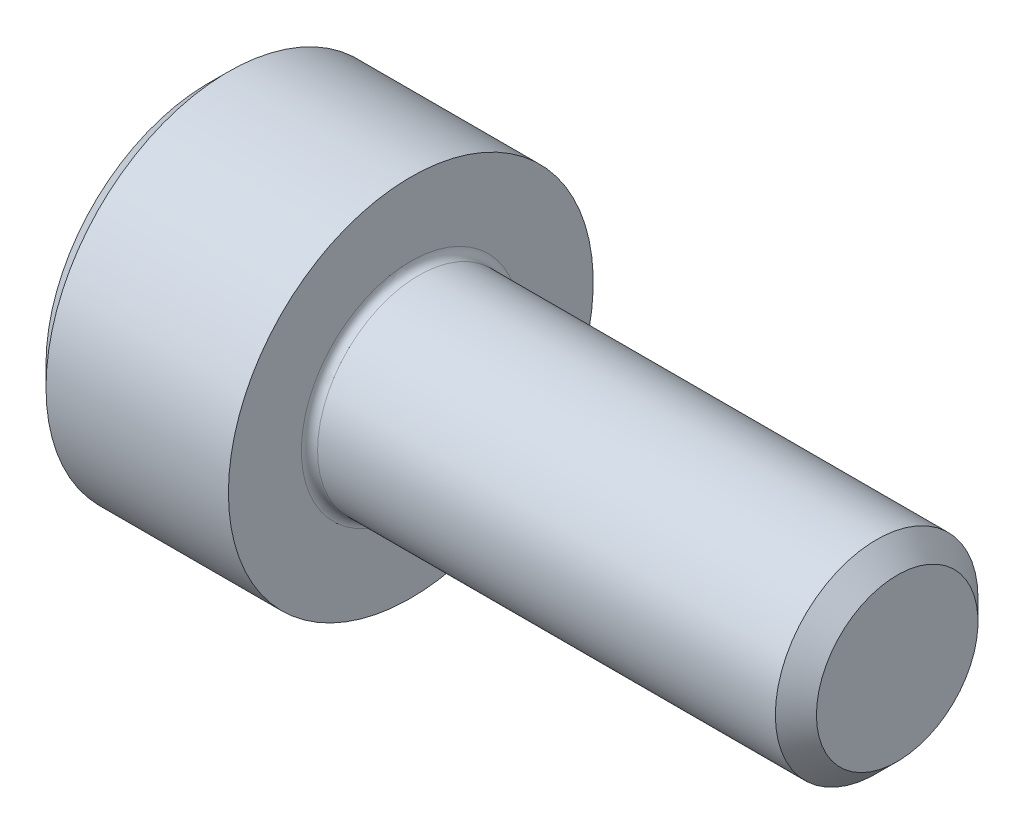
from build123d import *

# Parameters (mm, degrees)
FILLET1_R   = 0.1
HEX_2_DEPTH = 1.1


with BuildPart() as part:
    # BodySke → Base-Revolve (revolve)
    with BuildSketch(Plane.XY, mode=Mode.PRIVATE) as base_revolve_sk:
        Polygon((0, 0), (0, 2), (0.25, 2.25), (2.5, 2.25), (2.5, 1.25), (8.2465, 1.25), (8.5, 0.9965), (8.5, 0), align=None)
    revolve(base_revolve_sk.sketch.rotate(Axis((-31.75, 0, 0), (1, 0, 0)), 90), axis=Axis((-31.75, 0, 0), (1, 0, 0)))

    # Fillet1
    fillet1_edges = [part.edges().sort_by_distance(p)[0] for p in [
        (2.5, 0, -1.25),
    ]]
    fillet(fillet1_edges, radius=FILLET1_R)

    # Sketch2 → Hex-PreBroach (revolve, cut)
    with BuildSketch(Plane.XY, mode=Mode.PRIVATE) as hex_prebroach_sk:
        Polygon((0, 1.0225), (1.1, 1.0225), (1.69034065, 0), (0, 0), align=None)
    revolve(hex_prebroach_sk.sketch.rotate(Axis((0, 0, 0), (1, 0, 0)), 90), axis=Axis((0, 0, 0), (1, 0, 0)), mode=Mode.SUBTRACT)

    # Sketch3 → Hex 2 (cut)
    with BuildSketch(Plane(origin=(0, 0, 0), x_dir=(0, 0.500000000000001, 0.866025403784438), z_dir=(-1, 0, 0))):
        Polygon((0.59034065, 1.0225), (-0.59034065, 1.0225), (-1.1806813, 0), (-0.59034065, -1.0225), (0.59034065, -1.0225), (1.1806813, 0), align=None)
    extrude(amount=-HEX_2_DEPTH, mode=Mode.SUBTRACT)


solid = part.part
